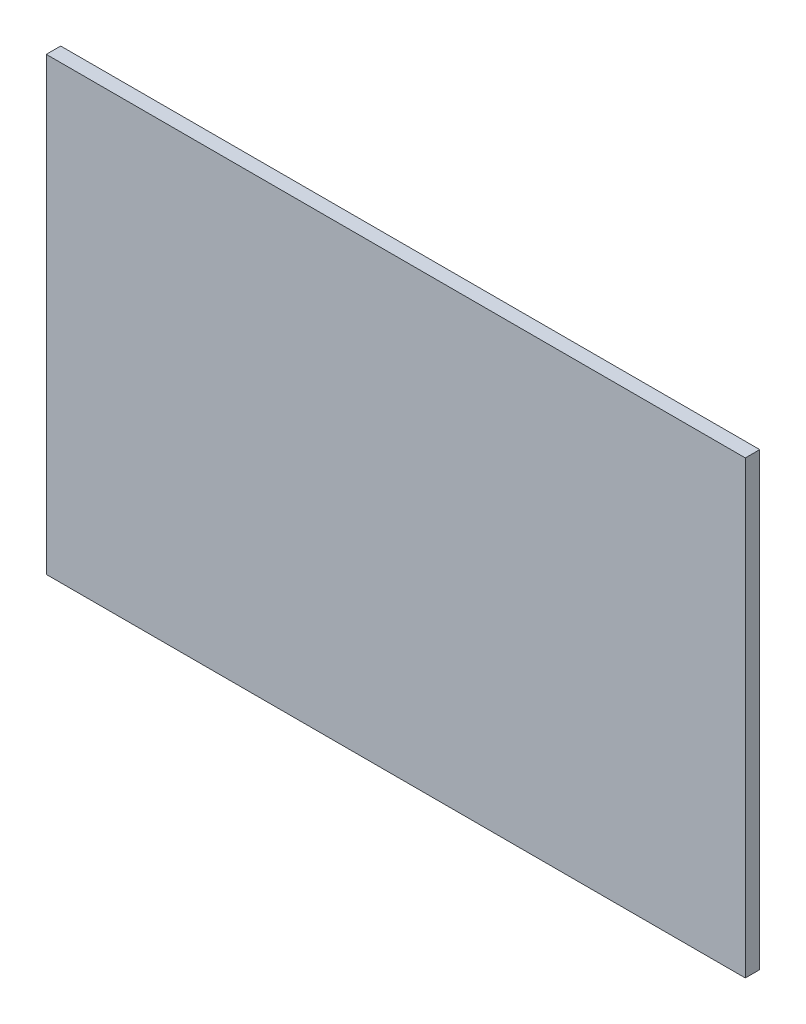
ISO-10303-21;
HEADER;
FILE_DESCRIPTION(('STEP AP214'),'2;1');
FILE_NAME('part.step','',(''),(''),'','','');
FILE_SCHEMA(('AUTOMOTIVE_DESIGN { 1 0 10303 214 1 1 1 1 }'));
ENDSEC;
DATA;
#1=APPLICATION_CONTEXT('core data for automotive mechanical design processes');
#2=APPLICATION_PROTOCOL_DEFINITION('international standard','automotive_design',2000,#1);
#3=PRODUCT_CONTEXT('',#1,'mechanical');
#4=PRODUCT('Part','Part','',(#3));
#5=PRODUCT_RELATED_PRODUCT_CATEGORY('part','',(#4));
#6=PRODUCT_DEFINITION_FORMATION('','',#4);
#7=PRODUCT_DEFINITION_CONTEXT('part definition',#1,'design');
#8=PRODUCT_DEFINITION('design','',#6,#7);
#9=PRODUCT_DEFINITION_SHAPE('','',#8);
#10=(LENGTH_UNIT() NAMED_UNIT(*) SI_UNIT(.MILLI.,.METRE.));
#11=(NAMED_UNIT(*) PLANE_ANGLE_UNIT() SI_UNIT($,.RADIAN.));
#12=(NAMED_UNIT(*) SI_UNIT($,.STERADIAN.) SOLID_ANGLE_UNIT());
#13=UNCERTAINTY_MEASURE_WITH_UNIT(LENGTH_MEASURE(1.E-05),#10,'distance_accuracy_value','');
#14=(GEOMETRIC_REPRESENTATION_CONTEXT(3) GLOBAL_UNCERTAINTY_ASSIGNED_CONTEXT((#13)) GLOBAL_UNIT_ASSIGNED_CONTEXT((#10,
#11,#12)) REPRESENTATION_CONTEXT('',''));
#15=CARTESIAN_POINT('',(0.,0.,0.));
#16=DIRECTION('',(0.,0.,1.));
#17=DIRECTION('',(1.,0.,0.));
#18=AXIS2_PLACEMENT_3D('',#15,#16,#17);
#19=CARTESIAN_POINT('',(-194.,125.,8.));
#20=DIRECTION('',(1.,0.,0.));
#21=DIRECTION('',(0.,1.,0.));
#22=AXIS2_PLACEMENT_3D('',#19,#20,#21);
#23=PLANE('',#22);
#24=DIRECTION('',(0.,-1.,0.));
#25=VECTOR('',#24,1.);
#26=CARTESIAN_POINT('',(-194.,125.,0.));
#27=LINE('',#26,#25);
#28=CARTESIAN_POINT('',(-194.,125.,0.));
#29=VERTEX_POINT('',#28);
#30=CARTESIAN_POINT('',(-194.,-125.,0.));
#31=VERTEX_POINT('',#30);
#32=EDGE_CURVE('E107',#29,#31,#27,.T.);
#33=ORIENTED_EDGE('',*,*,#32,.T.);
#34=DIRECTION('',(0.,0.,-1.));
#35=VECTOR('',#34,1.);
#36=CARTESIAN_POINT('',(-194.,-125.,8.));
#37=LINE('',#36,#35);
#38=CARTESIAN_POINT('',(-194.,-125.,8.));
#39=VERTEX_POINT('',#38);
#40=EDGE_CURVE('E11',#39,#31,#37,.T.);
#41=ORIENTED_EDGE('',*,*,#40,.F.);
#42=DIRECTION('',(0.,-1.,0.));
#43=VECTOR('',#42,1.);
#44=CARTESIAN_POINT('',(-194.,125.,8.));
#45=LINE('',#44,#43);
#46=CARTESIAN_POINT('',(-194.,125.,8.));
#47=VERTEX_POINT('',#46);
#48=EDGE_CURVE('E91',#47,#39,#45,.T.);
#49=ORIENTED_EDGE('',*,*,#48,.F.);
#50=DIRECTION('',(0.,0.,-1.));
#51=VECTOR('',#50,1.);
#52=CARTESIAN_POINT('',(-194.,125.,8.));
#53=LINE('',#52,#51);
#54=EDGE_CURVE('E103',#47,#29,#53,.T.);
#55=ORIENTED_EDGE('',*,*,#54,.T.);
#56=EDGE_LOOP('',(#33,#41,#49,#55));
#57=FACE_BOUND('',#56,.T.);
#58=ADVANCED_FACE('F39',(#57),#23,.F.);
#59=CARTESIAN_POINT('',(-194.,-125.,8.));
#60=DIRECTION('',(0.,1.,0.));
#61=DIRECTION('',(0.,0.,1.));
#62=AXIS2_PLACEMENT_3D('',#59,#60,#61);
#63=PLANE('',#62);
#64=DIRECTION('',(1.,0.,0.));
#65=VECTOR('',#64,1.);
#66=CARTESIAN_POINT('',(-194.,-125.,0.));
#67=LINE('',#66,#65);
#68=CARTESIAN_POINT('',(194.,-125.,0.));
#69=VERTEX_POINT('',#68);
#70=EDGE_CURVE('E96',#31,#69,#67,.T.);
#71=ORIENTED_EDGE('',*,*,#70,.T.);
#72=DIRECTION('',(0.,0.,-1.));
#73=VECTOR('',#72,1.);
#74=CARTESIAN_POINT('',(194.,-125.,8.));
#75=LINE('',#74,#73);
#76=CARTESIAN_POINT('',(194.,-125.,8.));
#77=VERTEX_POINT('',#76);
#78=EDGE_CURVE('E48',#77,#69,#75,.T.);
#79=ORIENTED_EDGE('',*,*,#78,.F.);
#80=DIRECTION('',(1.,0.,0.));
#81=VECTOR('',#80,1.);
#82=CARTESIAN_POINT('',(-194.,-125.,8.));
#83=LINE('',#82,#81);
#84=EDGE_CURVE('E86',#39,#77,#83,.T.);
#85=ORIENTED_EDGE('',*,*,#84,.F.);
#86=ORIENTED_EDGE('',*,*,#40,.T.);
#87=EDGE_LOOP('',(#71,#79,#85,#86));
#88=FACE_BOUND('',#87,.T.);
#89=ADVANCED_FACE('F95',(#88),#63,.F.);
#90=CARTESIAN_POINT('',(194.,125.,8.));
#91=DIRECTION('',(-1.,0.,0.));
#92=DIRECTION('',(0.,-1.,0.));
#93=AXIS2_PLACEMENT_3D('',#90,#91,#92);
#94=PLANE('',#93);
#95=DIRECTION('',(0.,1.,0.));
#96=VECTOR('',#95,1.);
#97=CARTESIAN_POINT('',(194.,125.,0.));
#98=LINE('',#97,#96);
#99=CARTESIAN_POINT('',(194.,125.,0.));
#100=VERTEX_POINT('',#99);
#101=EDGE_CURVE('E73',#69,#100,#98,.T.);
#102=ORIENTED_EDGE('',*,*,#101,.T.);
#103=DIRECTION('',(0.,0.,-1.));
#104=VECTOR('',#103,1.);
#105=CARTESIAN_POINT('',(194.,125.,8.));
#106=LINE('',#105,#104);
#107=CARTESIAN_POINT('',(194.,125.,8.));
#108=VERTEX_POINT('',#107);
#109=EDGE_CURVE('E98',#108,#100,#106,.T.);
#110=ORIENTED_EDGE('',*,*,#109,.F.);
#111=DIRECTION('',(0.,1.,0.));
#112=VECTOR('',#111,1.);
#113=CARTESIAN_POINT('',(194.,125.,8.));
#114=LINE('',#113,#112);
#115=EDGE_CURVE('E89',#77,#108,#114,.T.);
#116=ORIENTED_EDGE('',*,*,#115,.F.);
#117=ORIENTED_EDGE('',*,*,#78,.T.);
#118=EDGE_LOOP('',(#102,#110,#116,#117));
#119=FACE_BOUND('',#118,.T.);
#120=ADVANCED_FACE('F99',(#119),#94,.F.);
#121=CARTESIAN_POINT('',(-194.,125.,8.));
#122=DIRECTION('',(0.,-1.,0.));
#123=DIRECTION('',(0.,0.,-1.));
#124=AXIS2_PLACEMENT_3D('',#121,#122,#123);
#125=PLANE('',#124);
#126=DIRECTION('',(-1.,0.,0.));
#127=VECTOR('',#126,1.);
#128=CARTESIAN_POINT('',(-194.,125.,0.));
#129=LINE('',#128,#127);
#130=EDGE_CURVE('E79',#100,#29,#129,.T.);
#131=ORIENTED_EDGE('',*,*,#130,.T.);
#132=ORIENTED_EDGE('',*,*,#54,.F.);
#133=DIRECTION('',(-1.,0.,0.));
#134=VECTOR('',#133,1.);
#135=CARTESIAN_POINT('',(-194.,125.,8.));
#136=LINE('',#135,#134);
#137=EDGE_CURVE('E56',#108,#47,#136,.T.);
#138=ORIENTED_EDGE('',*,*,#137,.F.);
#139=ORIENTED_EDGE('',*,*,#109,.T.);
#140=EDGE_LOOP('',(#131,#132,#138,#139));
#141=FACE_BOUND('',#140,.T.);
#142=ADVANCED_FACE('F120',(#141),#125,.F.);
#143=CARTESIAN_POINT('',(0.,0.,8.));
#144=DIRECTION('',(0.,0.,1.));
#145=DIRECTION('',(1.,0.,0.));
#146=AXIS2_PLACEMENT_3D('',#143,#144,#145);
#147=PLANE('',#146);
#148=ORIENTED_EDGE('',*,*,#48,.T.);
#149=ORIENTED_EDGE('',*,*,#84,.T.);
#150=ORIENTED_EDGE('',*,*,#115,.T.);
#151=ORIENTED_EDGE('',*,*,#137,.T.);
#152=EDGE_LOOP('',(#148,#149,#150,#151));
#153=FACE_BOUND('',#152,.T.);
#154=ADVANCED_FACE('F87',(#153),#147,.T.);
#155=CARTESIAN_POINT('',(0.,0.,0.));
#156=DIRECTION('',(0.,0.,1.));
#157=DIRECTION('',(1.,0.,0.));
#158=AXIS2_PLACEMENT_3D('',#155,#156,#157);
#159=PLANE('',#158);
#160=ORIENTED_EDGE('',*,*,#32,.F.);
#161=ORIENTED_EDGE('',*,*,#130,.F.);
#162=ORIENTED_EDGE('',*,*,#101,.F.);
#163=ORIENTED_EDGE('',*,*,#70,.F.);
#164=EDGE_LOOP('',(#160,#161,#162,#163));
#165=FACE_BOUND('',#164,.T.);
#166=ADVANCED_FACE('F123',(#165),#159,.F.);
#167=CLOSED_SHELL('',(#58,#89,#120,#142,#154,#166));
#168=MANIFOLD_SOLID_BREP('B2',#167);
#169=ADVANCED_BREP_SHAPE_REPRESENTATION('',(#18,#168),#14);
#170=SHAPE_DEFINITION_REPRESENTATION(#9,#169);
ENDSEC;
END-ISO-10303-21;
